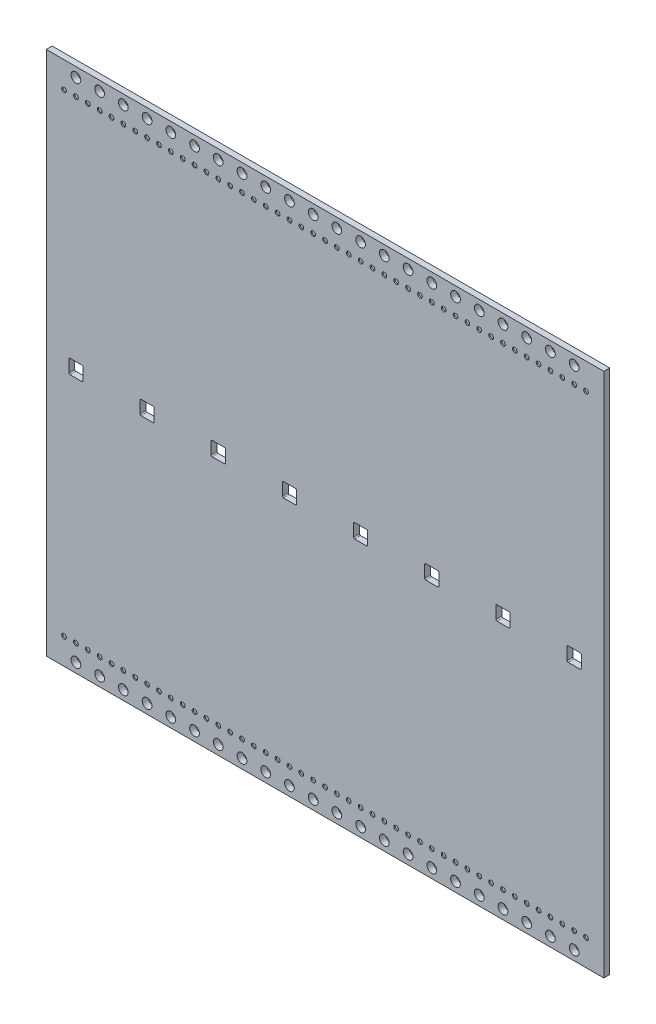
from build123d import *

# Parameters (mm, degrees)
SKETCH_1_W          = 235
SKETCH_1_H          = 221.45
SKETCH_1_R          = 2.05
EXTRUDE_1_DEPTH     = 1.25
SKETCH_2_R          = 1
CUT_EXTRUDE_1_DEPTH = 0.5
SKETCH_3_R          = 1
EXTRUDE_2_DEPTH     = 1
CUT_EXTRUDE_2_DEPTH = 10


with BuildPart() as part:
    # Sketch 1 → Extrude 1 (new, symmetric)
    with BuildSketch(Plane.XY):
        Rectangle(SKETCH_1_W, SKETCH_1_H)
        with Locations((-105, 106.725)):
            Circle(SKETCH_1_R, mode=Mode.SUBTRACT)
        with Locations((-95, 106.725)):
            Circle(SKETCH_1_R, mode=Mode.SUBTRACT)
        with Locations((-95, -106.725)):
            Circle(SKETCH_1_R, mode=Mode.SUBTRACT)
        with Locations((-85, 106.725)):
            Circle(SKETCH_1_R, mode=Mode.SUBTRACT)
        with Locations((-85, -106.725)):
            Circle(SKETCH_1_R, mode=Mode.SUBTRACT)
        with Locations((-75, 106.725)):
            Circle(SKETCH_1_R, mode=Mode.SUBTRACT)
        with Locations((-75, -106.725)):
            Circle(SKETCH_1_R, mode=Mode.SUBTRACT)
        with Locations((-65, 106.725)):
            Circle(SKETCH_1_R, mode=Mode.SUBTRACT)
        with Locations((-65, -106.725)):
            Circle(SKETCH_1_R, mode=Mode.SUBTRACT)
        with Locations((-55, 106.725)):
            Circle(SKETCH_1_R, mode=Mode.SUBTRACT)
        with Locations((-55, -106.725)):
            Circle(SKETCH_1_R, mode=Mode.SUBTRACT)
        with Locations((-45, 106.725)):
            Circle(SKETCH_1_R, mode=Mode.SUBTRACT)
        with Locations((-45, -106.725)):
            Circle(SKETCH_1_R, mode=Mode.SUBTRACT)
        with Locations((-35, 106.725)):
            Circle(SKETCH_1_R, mode=Mode.SUBTRACT)
        with Locations((-35, -106.725)):
            Circle(SKETCH_1_R, mode=Mode.SUBTRACT)
        with Locations((-25, 106.725)):
            Circle(SKETCH_1_R, mode=Mode.SUBTRACT)
        with Locations((-25, -106.725)):
            Circle(SKETCH_1_R, mode=Mode.SUBTRACT)
        with Locations((-15, 106.725)):
            Circle(SKETCH_1_R, mode=Mode.SUBTRACT)
        with Locations((-15, -106.725)):
            Circle(SKETCH_1_R, mode=Mode.SUBTRACT)
        with Locations((-5, 106.725)):
            Circle(SKETCH_1_R, mode=Mode.SUBTRACT)
        with Locations((-5, -106.725)):
            Circle(SKETCH_1_R, mode=Mode.SUBTRACT)
        with Locations((5, 106.725)):
            Circle(SKETCH_1_R, mode=Mode.SUBTRACT)
        with Locations((5, -106.725)):
            Circle(SKETCH_1_R, mode=Mode.SUBTRACT)
        with Locations((15, 106.725)):
            Circle(SKETCH_1_R, mode=Mode.SUBTRACT)
        with Locations((15, -106.725)):
            Circle(SKETCH_1_R, mode=Mode.SUBTRACT)
        with Locations((25, 106.725)):
            Circle(SKETCH_1_R, mode=Mode.SUBTRACT)
        with Locations((25, -106.725)):
            Circle(SKETCH_1_R, mode=Mode.SUBTRACT)
        with Locations((35, 106.725)):
            Circle(SKETCH_1_R, mode=Mode.SUBTRACT)
        with Locations((35, -106.725)):
            Circle(SKETCH_1_R, mode=Mode.SUBTRACT)
        with Locations((45, 106.725)):
            Circle(SKETCH_1_R, mode=Mode.SUBTRACT)
        with Locations((45, -106.725)):
            Circle(SKETCH_1_R, mode=Mode.SUBTRACT)
        with Locations((55, 106.725)):
            Circle(SKETCH_1_R, mode=Mode.SUBTRACT)
        with Locations((55, -106.725)):
            Circle(SKETCH_1_R, mode=Mode.SUBTRACT)
        with Locations((65, 106.725)):
            Circle(SKETCH_1_R, mode=Mode.SUBTRACT)
        with Locations((65, -106.725)):
            Circle(SKETCH_1_R, mode=Mode.SUBTRACT)
        with Locations((75, 106.725)):
            Circle(SKETCH_1_R, mode=Mode.SUBTRACT)
        with Locations((75, -106.725)):
            Circle(SKETCH_1_R, mode=Mode.SUBTRACT)
        with Locations((85, 106.725)):
            Circle(SKETCH_1_R, mode=Mode.SUBTRACT)
        with Locations((85, -106.725)):
            Circle(SKETCH_1_R, mode=Mode.SUBTRACT)
        with Locations((95, 106.725)):
            Circle(SKETCH_1_R, mode=Mode.SUBTRACT)
        with Locations((95, -106.725)):
            Circle(SKETCH_1_R, mode=Mode.SUBTRACT)
        with Locations((105, 106.725)):
            Circle(SKETCH_1_R, mode=Mode.SUBTRACT)
        with Locations((105, -106.725)):
            Circle(SKETCH_1_R, mode=Mode.SUBTRACT)
        with Locations((-105, -106.725)):
            Circle(SKETCH_1_R, mode=Mode.SUBTRACT)
    extrude(amount=EXTRUDE_1_DEPTH, both=True)

    # Sketch 2 → Cut-Extrude 1 (cut)
    with BuildSketch(Plane.XY.offset(1.25)):
        with Locations((-110, 99.725)):
            Circle(SKETCH_2_R)
        with Locations((-110, -99.725)):
            Circle(SKETCH_2_R)
        with Locations((-105, 99.725)):
            Circle(SKETCH_2_R)
        with Locations((-105, -99.725)):
            Circle(SKETCH_2_R)
        with Locations((-100, 99.725)):
            Circle(SKETCH_2_R)
        with Locations((-100, -99.725)):
            Circle(SKETCH_2_R)
        with Locations((-95, 99.725)):
            Circle(SKETCH_2_R)
        with Locations((-95, -99.725)):
            Circle(SKETCH_2_R)
        with Locations((-90, 99.725)):
            Circle(SKETCH_2_R)
        with Locations((-90, -99.725)):
            Circle(SKETCH_2_R)
        with Locations((-85, 99.725)):
            Circle(SKETCH_2_R)
        with Locations((-85, -99.725)):
            Circle(SKETCH_2_R)
        with Locations((-80, 99.725)):
            Circle(SKETCH_2_R)
        with Locations((-80, -99.725)):
            Circle(SKETCH_2_R)
        with Locations((-75, 99.725)):
            Circle(SKETCH_2_R)
        with Locations((-75, -99.725)):
            Circle(SKETCH_2_R)
        with Locations((-70, 99.725)):
            Circle(SKETCH_2_R)
        with Locations((-70, -99.725)):
            Circle(SKETCH_2_R)
        with Locations((-65, 99.725)):
            Circle(SKETCH_2_R)
        with Locations((-65, -99.725)):
            Circle(SKETCH_2_R)
        with Locations((-60, 99.725)):
            Circle(SKETCH_2_R)
        with Locations((-60, -99.725)):
            Circle(SKETCH_2_R)
        with Locations((-55, 99.725)):
            Circle(SKETCH_2_R)
        with Locations((-55, -99.725)):
            Circle(SKETCH_2_R)
        with Locations((-50, 99.725)):
            Circle(SKETCH_2_R)
        with Locations((-50, -99.725)):
            Circle(SKETCH_2_R)
        with Locations((-45, 99.725)):
            Circle(SKETCH_2_R)
        with Locations((-45, -99.725)):
            Circle(SKETCH_2_R)
        with Locations((-40, 99.725)):
            Circle(SKETCH_2_R)
        with Locations((-40, -99.725)):
            Circle(SKETCH_2_R)
        with Locations((-35, 99.725)):
            Circle(SKETCH_2_R)
        with Locations((-35, -99.725)):
            Circle(SKETCH_2_R)
        with Locations((-30, 99.725)):
            Circle(SKETCH_2_R)
        with Locations((-30, -99.725)):
            Circle(SKETCH_2_R)
        with Locations((-25, 99.725)):
            Circle(SKETCH_2_R)
        with Locations((-25, -99.725)):
            Circle(SKETCH_2_R)
        with Locations((-20, 99.725)):
            Circle(SKETCH_2_R)
        with Locations((-20, -99.725)):
            Circle(SKETCH_2_R)
        with Locations((-15, 99.725)):
            Circle(SKETCH_2_R)
        with Locations((-15, -99.725)):
            Circle(SKETCH_2_R)
        with Locations((-10, 99.725)):
            Circle(SKETCH_2_R)
        with Locations((-10, -99.725)):
            Circle(SKETCH_2_R)
        with Locations((-5, 99.725)):
            Circle(SKETCH_2_R)
        with Locations((-5, -99.725)):
            Circle(SKETCH_2_R)
        with Locations((0, 99.725)):
            Circle(SKETCH_2_R)
        with Locations((0, -99.725)):
            Circle(SKETCH_2_R)
        with Locations((5, 99.725)):
            Circle(SKETCH_2_R)
        with Locations((5, -99.725)):
            Circle(SKETCH_2_R)
        with Locations((10, 99.725)):
            Circle(SKETCH_2_R)
        with Locations((10, -99.725)):
            Circle(SKETCH_2_R)
        with Locations((15, 99.725)):
            Circle(SKETCH_2_R)
        with Locations((15, -99.725)):
            Circle(SKETCH_2_R)
        with Locations((20, 99.725)):
            Circle(SKETCH_2_R)
        with Locations((20, -99.725)):
            Circle(SKETCH_2_R)
        with Locations((25, 99.725)):
            Circle(SKETCH_2_R)
        with Locations((25, -99.725)):
            Circle(SKETCH_2_R)
        with Locations((30, 99.725)):
            Circle(SKETCH_2_R)
        with Locations((30, -99.725)):
            Circle(SKETCH_2_R)
        with Locations((35, 99.725)):
            Circle(SKETCH_2_R)
        with Locations((35, -99.725)):
            Circle(SKETCH_2_R)
        with Locations((40, 99.725)):
            Circle(SKETCH_2_R)
        with Locations((40, -99.725)):
            Circle(SKETCH_2_R)
        with Locations((45, 99.725)):
            Circle(SKETCH_2_R)
        with Locations((45, -99.725)):
            Circle(SKETCH_2_R)
        with Locations((50, 99.725)):
            Circle(SKETCH_2_R)
        with Locations((50, -99.725)):
            Circle(SKETCH_2_R)
        with Locations((55, 99.725)):
            Circle(SKETCH_2_R)
        with Locations((55, -99.725)):
            Circle(SKETCH_2_R)
        with Locations((60, 99.725)):
            Circle(SKETCH_2_R)
        with Locations((60, -99.725)):
            Circle(SKETCH_2_R)
        with Locations((65, 99.725)):
            Circle(SKETCH_2_R)
        with Locations((65, -99.725)):
            Circle(SKETCH_2_R)
        with Locations((70, 99.725)):
            Circle(SKETCH_2_R)
        with Locations((70, -99.725)):
            Circle(SKETCH_2_R)
        with Locations((75, 99.725)):
            Circle(SKETCH_2_R)
        with Locations((75, -99.725)):
            Circle(SKETCH_2_R)
        with Locations((80, 99.725)):
            Circle(SKETCH_2_R)
        with Locations((80, -99.725)):
            Circle(SKETCH_2_R)
        with Locations((85, 99.725)):
            Circle(SKETCH_2_R)
        with Locations((85, -99.725)):
            Circle(SKETCH_2_R)
        with Locations((90, 99.725)):
            Circle(SKETCH_2_R)
        with Locations((90, -99.725)):
            Circle(SKETCH_2_R)
        with Locations((95, 99.725)):
            Circle(SKETCH_2_R)
        with Locations((95, -99.725)):
            Circle(SKETCH_2_R)
        with Locations((100, 99.725)):
            Circle(SKETCH_2_R)
        with Locations((100, -99.725)):
            Circle(SKETCH_2_R)
        with Locations((105, 99.725)):
            Circle(SKETCH_2_R)
        with Locations((105, -99.725)):
            Circle(SKETCH_2_R)
        with Locations((110, 99.725)):
            Circle(SKETCH_2_R)
        with Locations((110, -99.725)):
            Circle(SKETCH_2_R)
    extrude(amount=-CUT_EXTRUDE_1_DEPTH, mode=Mode.SUBTRACT)

    # Sketch 3 → Extrude 2 (add)
    with BuildSketch(Plane(origin=(0, 0, -1.25), x_dir=(-1, 0, 0), z_dir=(0, 0, -1))):
        with Locations(Location((110, 99.725, 0), (0, 0, 180))):
            Circle(SKETCH_3_R)
        with Locations(Location((110, -99.725, 0), (0, 0, 180))):
            Circle(SKETCH_3_R)
        with Locations(Location((105, 99.725, 0), (0, 0, 180))):
            Circle(SKETCH_3_R)
        with Locations(Location((105, -99.725, 0), (0, 0, 180))):
            Circle(SKETCH_3_R)
        with Locations(Location((100, 99.725, 0), (0, 0, 180))):
            Circle(SKETCH_3_R)
        with Locations(Location((100, -99.725, 0), (0, 0, 180))):
            Circle(SKETCH_3_R)
        with Locations(Location((95, 99.725, 0), (0, 0, 180))):
            Circle(SKETCH_3_R)
        with Locations(Location((95, -99.725, 0), (0, 0, 180))):
            Circle(SKETCH_3_R)
        with Locations(Location((90, 99.725, 0), (0, 0, 180))):
            Circle(SKETCH_3_R)
        with Locations(Location((90, -99.725, 0), (0, 0, 180))):
            Circle(SKETCH_3_R)
        with Locations(Location((85, 99.725, 0), (0, 0, 180))):
            Circle(SKETCH_3_R)
        with Locations(Location((85, -99.725, 0), (0, 0, 180))):
            Circle(SKETCH_3_R)
        with Locations(Location((80, 99.725, 0), (0, 0, 180))):
            Circle(SKETCH_3_R)
        with Locations(Location((80, -99.725, 0), (0, 0, 180))):
            Circle(SKETCH_3_R)
        with Locations(Location((75, 99.725, 0), (0, 0, 180))):
            Circle(SKETCH_3_R)
        with Locations(Location((75, -99.725, 0), (0, 0, 180))):
            Circle(SKETCH_3_R)
        with Locations(Location((70, 99.725, 0), (0, 0, 180))):
            Circle(SKETCH_3_R)
        with Locations(Location((70, -99.725, 0), (0, 0, 180))):
            Circle(SKETCH_3_R)
        with Locations(Location((65, 99.725, 0), (0, 0, 180))):
            Circle(SKETCH_3_R)
        with Locations(Location((65, -99.725, 0), (0, 0, 180))):
            Circle(SKETCH_3_R)
        with Locations(Location((60, 99.725, 0), (0, 0, 180))):
            Circle(SKETCH_3_R)
        with Locations(Location((60, -99.725, 0), (0, 0, 180))):
            Circle(SKETCH_3_R)
        with Locations(Location((55, 99.725, 0), (0, 0, 180))):
            Circle(SKETCH_3_R)
        with Locations(Location((55, -99.725, 0), (0, 0, 180))):
            Circle(SKETCH_3_R)
        with Locations(Location((50, 99.725, 0), (0, 0, 180))):
            Circle(SKETCH_3_R)
        with Locations(Location((50, -99.725, 0), (0, 0, 180))):
            Circle(SKETCH_3_R)
        with Locations(Location((45, 99.725, 0), (0, 0, 180))):
            Circle(SKETCH_3_R)
        with Locations(Location((45, -99.725, 0), (0, 0, 180))):
            Circle(SKETCH_3_R)
        with Locations(Location((40, 99.725, 0), (0, 0, 180))):
            Circle(SKETCH_3_R)
        with Locations(Location((40, -99.725, 0), (0, 0, 180))):
            Circle(SKETCH_3_R)
        with Locations(Location((35, 99.725, 0), (0, 0, 180))):
            Circle(SKETCH_3_R)
        with Locations(Location((35, -99.725, 0), (0, 0, 180))):
            Circle(SKETCH_3_R)
        with Locations(Location((30, 99.725, 0), (0, 0, 180))):
            Circle(SKETCH_3_R)
        with Locations(Location((30, -99.725, 0), (0, 0, 180))):
            Circle(SKETCH_3_R)
        with Locations(Location((25, 99.725, 0), (0, 0, 180))):
            Circle(SKETCH_3_R)
        with Locations(Location((25, -99.725, 0), (0, 0, 180))):
            Circle(SKETCH_3_R)
        with Locations(Location((20, 99.725, 0), (0, 0, 180))):
            Circle(SKETCH_3_R)
        with Locations(Location((20, -99.725, 0), (0, 0, 180))):
            Circle(SKETCH_3_R)
        with Locations(Location((15, 99.725, 0), (0, 0, 180))):
            Circle(SKETCH_3_R)
        with Locations(Location((15, -99.725, 0), (0, 0, 180))):
            Circle(SKETCH_3_R)
        with Locations(Location((10, 99.725, 0), (0, 0, 180))):
            Circle(SKETCH_3_R)
        with Locations(Location((10, -99.725, 0), (0, 0, 180))):
            Circle(SKETCH_3_R)
        with Locations(Location((5, 99.725, 0), (0, 0, 180))):
            Circle(SKETCH_3_R)
        with Locations(Location((5, -99.725, 0), (0, 0, 180))):
            Circle(SKETCH_3_R)
        with Locations(Location((0, 99.725, 0), (0, 0, 180))):
            Circle(SKETCH_3_R)
        with Locations(Location((0, -99.725, 0), (0, 0, 180))):
            Circle(SKETCH_3_R)
        with Locations(Location((-5, 99.725, 0), (0, 0, 180))):
            Circle(SKETCH_3_R)
        with Locations(Location((-5, -99.725, 0), (0, 0, 180))):
            Circle(SKETCH_3_R)
        with Locations(Location((-10, 99.725, 0), (0, 0, 180))):
            Circle(SKETCH_3_R)
        with Locations(Location((-10, -99.725, 0), (0, 0, 180))):
            Circle(SKETCH_3_R)
        with Locations(Location((-15, 99.725, 0), (0, 0, 180))):
            Circle(SKETCH_3_R)
        with Locations(Location((-15, -99.725, 0), (0, 0, 180))):
            Circle(SKETCH_3_R)
        with Locations(Location((-20, 99.725, 0), (0, 0, 180))):
            Circle(SKETCH_3_R)
        with Locations(Location((-20, -99.725, 0), (0, 0, 180))):
            Circle(SKETCH_3_R)
        with Locations(Location((-25, 99.725, 0), (0, 0, 180))):
            Circle(SKETCH_3_R)
        with Locations(Location((-25, -99.725, 0), (0, 0, 180))):
            Circle(SKETCH_3_R)
        with Locations(Location((-30, 99.725, 0), (0, 0, 180))):
            Circle(SKETCH_3_R)
        with Locations(Location((-30, -99.725, 0), (0, 0, 180))):
            Circle(SKETCH_3_R)
        with Locations(Location((-35, 99.725, 0), (0, 0, 180))):
            Circle(SKETCH_3_R)
        with Locations(Location((-35, -99.725, 0), (0, 0, 180))):
            Circle(SKETCH_3_R)
        with Locations(Location((-40, 99.725, 0), (0, 0, 180))):
            Circle(SKETCH_3_R)
        with Locations(Location((-40, -99.725, 0), (0, 0, 180))):
            Circle(SKETCH_3_R)
        with Locations(Location((-45, 99.725, 0), (0, 0, 180))):
            Circle(SKETCH_3_R)
        with Locations(Location((-45, -99.725, 0), (0, 0, 180))):
            Circle(SKETCH_3_R)
        with Locations(Location((-50, 99.725, 0), (0, 0, 180))):
            Circle(SKETCH_3_R)
        with Locations(Location((-50, -99.725, 0), (0, 0, 180))):
            Circle(SKETCH_3_R)
        with Locations(Location((-55, 99.725, 0), (0, 0, 180))):
            Circle(SKETCH_3_R)
        with Locations(Location((-55, -99.725, 0), (0, 0, 180))):
            Circle(SKETCH_3_R)
        with Locations(Location((-60, 99.725, 0), (0, 0, 180))):
            Circle(SKETCH_3_R)
        with Locations(Location((-60, -99.725, 0), (0, 0, 180))):
            Circle(SKETCH_3_R)
        with Locations(Location((-65, 99.725, 0), (0, 0, 180))):
            Circle(SKETCH_3_R)
        with Locations(Location((-65, -99.725, 0), (0, 0, 180))):
            Circle(SKETCH_3_R)
        with Locations(Location((-70, 99.725, 0), (0, 0, 180))):
            Circle(SKETCH_3_R)
        with Locations(Location((-70, -99.725, 0), (0, 0, 180))):
            Circle(SKETCH_3_R)
        with Locations(Location((-75, 99.725, 0), (0, 0, 180))):
            Circle(SKETCH_3_R)
        with Locations(Location((-75, -99.725, 0), (0, 0, 180))):
            Circle(SKETCH_3_R)
        with Locations(Location((-80, 99.725, 0), (0, 0, 180))):
            Circle(SKETCH_3_R)
        with Locations(Location((-80, -99.725, 0), (0, 0, 180))):
            Circle(SKETCH_3_R)
        with Locations(Location((-85, 99.725, 0), (0, 0, 180))):
            Circle(SKETCH_3_R)
        with Locations(Location((-85, -99.725, 0), (0, 0, 180))):
            Circle(SKETCH_3_R)
        with Locations(Location((-90, 99.725, 0), (0, 0, 180))):
            Circle(SKETCH_3_R)
        with Locations(Location((-90, -99.725, 0), (0, 0, 180))):
            Circle(SKETCH_3_R)
        with Locations(Location((-95, 99.725, 0), (0, 0, 180))):
            Circle(SKETCH_3_R)
        with Locations(Location((-95, -99.725, 0), (0, 0, 180))):
            Circle(SKETCH_3_R)
        with Locations(Location((-100, 99.725, 0), (0, 0, 180))):
            Circle(SKETCH_3_R)
        with Locations(Location((-100, -99.725, 0), (0, 0, 180))):
            Circle(SKETCH_3_R)
        with Locations(Location((-105, 99.725, 0), (0, 0, 180))):
            Circle(SKETCH_3_R)
        with Locations(Location((-105, -99.725, 0), (0, 0, 180))):
            Circle(SKETCH_3_R)
        with Locations(Location((-110, 99.725, 0), (0, 0, 180))):
            Circle(SKETCH_3_R)
        with Locations(Location((-110, -99.725, 0), (0, 0, 180))):
            Circle(SKETCH_3_R)
    extrude(amount=EXTRUDE_2_DEPTH)

    # Sketch 4 → Cut-Extrude 2 (cut)
    with BuildSketch(Plane.XY.offset(1.25)):
        with BuildLine():
            Line((-107.5, -3), (-102.5, -3))
            ThreePointArc((-102.5, -3), (-102.146446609, -2.853553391), (-102, -2.5))
            Line((-102, -2.5), (-102, 2.5))
            ThreePointArc((-102, 2.5), (-102.146446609, 2.853553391), (-102.5, 3))
            Line((-102.5, 3), (-107.5, 3))
            ThreePointArc((-107.5, 3), (-107.853553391, 2.853553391), (-108, 2.5))
            Line((-108, 2.5), (-108, -2.5))
            ThreePointArc((-108, -2.5), (-107.853553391, -2.853553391), (-107.5, -3))
        make_face()
        with BuildLine():
            Line((-77.5, 3), (-72.5, 3))
            ThreePointArc((-72.5, 3), (-72.146446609, 2.853553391), (-72, 2.5))
            Line((-72, 2.5), (-72, -2.5))
            ThreePointArc((-72, -2.5), (-72.146446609, -2.853553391), (-72.5, -3))
            Line((-72.5, -3), (-77.5, -3))
            ThreePointArc((-77.5, -3), (-77.853553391, -2.853553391), (-78, -2.5))
            Line((-78, -2.5), (-78, 2.5))
            ThreePointArc((-78, 2.5), (-77.853553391, 2.853553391), (-77.5, 3))
        make_face()
        with BuildLine():
            Line((-47.5, 3), (-42.5, 3))
            ThreePointArc((-42.5, 3), (-42.146446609, 2.853553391), (-42, 2.5))
            Line((-42, 2.5), (-42, -2.5))
            ThreePointArc((-42, -2.5), (-42.146446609, -2.853553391), (-42.5, -3))
            Line((-42.5, -3), (-47.5, -3))
            ThreePointArc((-47.5, -3), (-47.853553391, -2.853553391), (-48, -2.5))
            Line((-48, -2.5), (-48, 2.5))
            ThreePointArc((-48, 2.5), (-47.853553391, 2.853553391), (-47.5, 3))
        make_face()
        with BuildLine():
            Line((-17.5, 3), (-12.5, 3))
            ThreePointArc((-12.5, 3), (-12.146446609, 2.853553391), (-12, 2.5))
            Line((-12, 2.5), (-12, -2.5))
            ThreePointArc((-12, -2.5), (-12.146446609, -2.853553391), (-12.5, -3))
            Line((-12.5, -3), (-17.5, -3))
            ThreePointArc((-17.5, -3), (-17.853553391, -2.853553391), (-18, -2.5))
            Line((-18, -2.5), (-18, 2.5))
            ThreePointArc((-18, 2.5), (-17.853553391, 2.853553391), (-17.5, 3))
        make_face()
        with BuildLine():
            Line((12.5, 3), (17.5, 3))
            ThreePointArc((17.5, 3), (17.853553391, 2.853553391), (18, 2.5))
            Line((18, 2.5), (18, -2.5))
            ThreePointArc((18, -2.5), (17.853553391, -2.853553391), (17.5, -3))
            Line((17.5, -3), (12.5, -3))
            ThreePointArc((12.5, -3), (12.146446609, -2.853553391), (12, -2.5))
            Line((12, -2.5), (12, 2.5))
            ThreePointArc((12, 2.5), (12.146446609, 2.853553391), (12.5, 3))
        make_face()
        with BuildLine():
            Line((42.5, 3), (47.5, 3))
            ThreePointArc((47.5, 3), (47.853553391, 2.853553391), (48, 2.5))
            Line((48, 2.5), (48, -2.5))
            ThreePointArc((48, -2.5), (47.853553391, -2.853553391), (47.5, -3))
            Line((47.5, -3), (42.5, -3))
            ThreePointArc((42.5, -3), (42.146446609, -2.853553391), (42, -2.5))
            Line((42, -2.5), (42, 2.5))
            ThreePointArc((42, 2.5), (42.146446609, 2.853553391), (42.5, 3))
        make_face()
        with BuildLine():
            Line((72.5, 3), (77.5, 3))
            ThreePointArc((77.5, 3), (77.853553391, 2.853553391), (78, 2.5))
            Line((78, 2.5), (78, -2.5))
            ThreePointArc((78, -2.5), (77.853553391, -2.853553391), (77.5, -3))
            Line((77.5, -3), (72.5, -3))
            ThreePointArc((72.5, -3), (72.146446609, -2.853553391), (72, -2.5))
            Line((72, -2.5), (72, 2.5))
            ThreePointArc((72, 2.5), (72.146446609, 2.853553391), (72.5, 3))
        make_face()
        with BuildLine():
            Line((102.5, 3), (107.5, 3))
            ThreePointArc((107.5, 3), (107.853553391, 2.853553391), (108, 2.5))
            Line((108, 2.5), (108, -2.5))
            ThreePointArc((108, -2.5), (107.853553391, -2.853553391), (107.5, -3))
            Line((107.5, -3), (102.5, -3))
            ThreePointArc((102.5, -3), (102.146446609, -2.853553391), (102, -2.5))
            Line((102, -2.5), (102, 2.5))
            ThreePointArc((102, 2.5), (102.146446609, 2.853553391), (102.5, 3))
        make_face()
    extrude(amount=-CUT_EXTRUDE_2_DEPTH, mode=Mode.SUBTRACT)


solid = part.part
